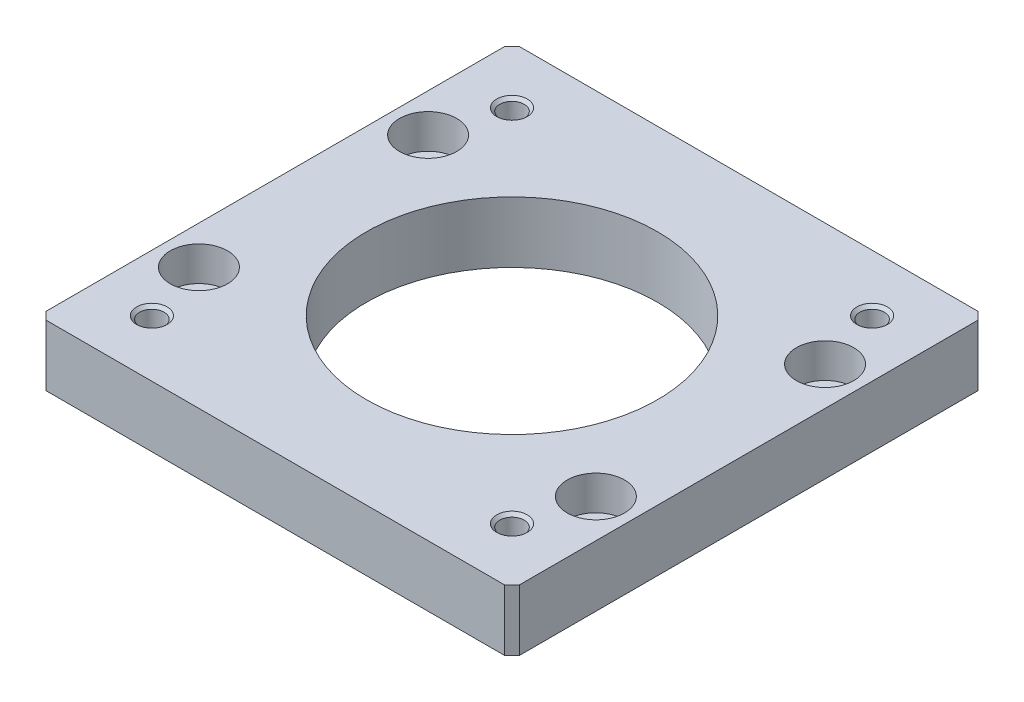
ISO-10303-21;
HEADER;
FILE_DESCRIPTION(('STEP AP214'),'2;1');
FILE_NAME('part.step','',(''),(''),'','','');
FILE_SCHEMA(('AUTOMOTIVE_DESIGN { 1 0 10303 214 1 1 1 1 }'));
ENDSEC;
DATA;
#1=APPLICATION_CONTEXT('core data for automotive mechanical design processes');
#2=APPLICATION_PROTOCOL_DEFINITION('international standard','automotive_design',2000,#1);
#3=PRODUCT_CONTEXT('',#1,'mechanical');
#4=PRODUCT('Part','Part','',(#3));
#5=PRODUCT_RELATED_PRODUCT_CATEGORY('part','',(#4));
#6=PRODUCT_DEFINITION_FORMATION('','',#4);
#7=PRODUCT_DEFINITION_CONTEXT('part definition',#1,'design');
#8=PRODUCT_DEFINITION('design','',#6,#7);
#9=PRODUCT_DEFINITION_SHAPE('','',#8);
#10=(LENGTH_UNIT() NAMED_UNIT(*) SI_UNIT(.MILLI.,.METRE.));
#11=(NAMED_UNIT(*) PLANE_ANGLE_UNIT() SI_UNIT($,.RADIAN.));
#12=(NAMED_UNIT(*) SI_UNIT($,.STERADIAN.) SOLID_ANGLE_UNIT());
#13=UNCERTAINTY_MEASURE_WITH_UNIT(LENGTH_MEASURE(1.E-05),#10,'distance_accuracy_value','');
#14=(GEOMETRIC_REPRESENTATION_CONTEXT(3) GLOBAL_UNCERTAINTY_ASSIGNED_CONTEXT((#13)) GLOBAL_UNIT_ASSIGNED_CONTEXT((#10,
#11,#12)) REPRESENTATION_CONTEXT('',''));
#15=CARTESIAN_POINT('',(0.,0.,0.));
#16=DIRECTION('',(0.,0.,1.));
#17=DIRECTION('',(1.,0.,0.));
#18=AXIS2_PLACEMENT_3D('',#15,#16,#17);
#19=CARTESIAN_POINT('',(-23.57,7.59999999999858,-23.57));
#20=DIRECTION('',(0.,1.,0.));
#21=DIRECTION('',(-1.,0.,0.));
#22=AXIS2_PLACEMENT_3D('',#19,#20,#21);
#23=CONICAL_SURFACE('',#22,1.60000000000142,0.785398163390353);
#24=CARTESIAN_POINT('',(-23.57,7.6,-23.57));
#25=DIRECTION('',(0.,1.,0.));
#26=DIRECTION('',(1.,0.,0.));
#27=AXIS2_PLACEMENT_3D('',#24,#25,#26);
#28=CIRCLE('',#27,1.6);
#29=CARTESIAN_POINT('',(-21.97,7.6,-23.57));
#30=VERTEX_POINT('',#29);
#31=EDGE_CURVE('E191',#30,#30,#28,.F.);
#32=ORIENTED_EDGE('',*,*,#31,.T.);
#33=EDGE_LOOP('',(#32));
#34=FACE_BOUND('',#33,.T.);
#35=CARTESIAN_POINT('',(-23.57,8.00000000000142,-23.57));
#36=DIRECTION('',(0.,1.,0.));
#37=DIRECTION('',(-1.,0.,0.));
#38=AXIS2_PLACEMENT_3D('',#35,#36,#37);
#39=CIRCLE('',#38,1.99999999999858);
#40=CARTESIAN_POINT('',(-25.5699999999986,8.00000000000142,-23.57));
#41=VERTEX_POINT('',#40);
#42=EDGE_CURVE('E174',#41,#41,#39,.T.);
#43=ORIENTED_EDGE('',*,*,#42,.T.);
#44=EDGE_LOOP('',(#43));
#45=FACE_BOUND('',#44,.T.);
#46=ADVANCED_FACE('F16',(#34,#45),#23,.F.);
#47=CARTESIAN_POINT('',(23.57,7.59999999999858,-23.57));
#48=DIRECTION('',(0.,1.,0.));
#49=DIRECTION('',(0.,0.,1.));
#50=AXIS2_PLACEMENT_3D('',#47,#48,#49);
#51=CONICAL_SURFACE('',#50,1.60000000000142,0.78539816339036);
#52=CARTESIAN_POINT('',(23.57,7.6,-23.57));
#53=DIRECTION('',(0.,1.,0.));
#54=DIRECTION('',(1.,0.,0.));
#55=AXIS2_PLACEMENT_3D('',#52,#53,#54);
#56=CIRCLE('',#55,1.6);
#57=CARTESIAN_POINT('',(25.17,7.6,-23.57));
#58=VERTEX_POINT('',#57);
#59=EDGE_CURVE('E195',#58,#58,#56,.F.);
#60=ORIENTED_EDGE('',*,*,#59,.T.);
#61=EDGE_LOOP('',(#60));
#62=FACE_BOUND('',#61,.T.);
#63=CARTESIAN_POINT('',(23.57,8.00000000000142,-23.57));
#64=DIRECTION('',(0.,1.,0.));
#65=DIRECTION('',(0.,0.,1.));
#66=AXIS2_PLACEMENT_3D('',#63,#64,#65);
#67=CIRCLE('',#66,1.99999999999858);
#68=CARTESIAN_POINT('',(23.57,8.00000000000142,-21.5700000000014));
#69=VERTEX_POINT('',#68);
#70=EDGE_CURVE('E171',#69,#69,#67,.T.);
#71=ORIENTED_EDGE('',*,*,#70,.T.);
#72=EDGE_LOOP('',(#71));
#73=FACE_BOUND('',#72,.T.);
#74=ADVANCED_FACE('F359',(#62,#73),#51,.F.);
#75=CARTESIAN_POINT('',(-23.57,7.59999999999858,23.57));
#76=DIRECTION('',(0.,1.,0.));
#77=DIRECTION('',(0.,0.,1.));
#78=AXIS2_PLACEMENT_3D('',#75,#76,#77);
#79=CONICAL_SURFACE('',#78,1.60000000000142,0.78539816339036);
#80=CARTESIAN_POINT('',(-23.57,7.6,23.57));
#81=DIRECTION('',(0.,1.,0.));
#82=DIRECTION('',(1.,0.,0.));
#83=AXIS2_PLACEMENT_3D('',#80,#81,#82);
#84=CIRCLE('',#83,1.6);
#85=CARTESIAN_POINT('',(-21.97,7.6,23.57));
#86=VERTEX_POINT('',#85);
#87=EDGE_CURVE('E208',#86,#86,#84,.F.);
#88=ORIENTED_EDGE('',*,*,#87,.T.);
#89=EDGE_LOOP('',(#88));
#90=FACE_BOUND('',#89,.T.);
#91=CARTESIAN_POINT('',(-23.57,8.00000000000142,23.57));
#92=DIRECTION('',(0.,1.,0.));
#93=DIRECTION('',(0.,0.,1.));
#94=AXIS2_PLACEMENT_3D('',#91,#92,#93);
#95=CIRCLE('',#94,1.99999999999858);
#96=CARTESIAN_POINT('',(-23.57,8.00000000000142,25.5699999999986));
#97=VERTEX_POINT('',#96);
#98=EDGE_CURVE('E168',#97,#97,#95,.T.);
#99=ORIENTED_EDGE('',*,*,#98,.T.);
#100=EDGE_LOOP('',(#99));
#101=FACE_BOUND('',#100,.T.);
#102=ADVANCED_FACE('F355',(#90,#101),#79,.F.);
#103=CARTESIAN_POINT('',(23.57,7.59999999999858,23.57));
#104=DIRECTION('',(0.,1.,0.));
#105=DIRECTION('',(-1.,0.,0.));
#106=AXIS2_PLACEMENT_3D('',#103,#104,#105);
#107=CONICAL_SURFACE('',#106,1.60000000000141,0.785398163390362);
#108=CARTESIAN_POINT('',(23.57,7.6,23.57));
#109=DIRECTION('',(0.,1.,0.));
#110=DIRECTION('',(1.,0.,0.));
#111=AXIS2_PLACEMENT_3D('',#108,#109,#110);
#112=CIRCLE('',#111,1.6);
#113=CARTESIAN_POINT('',(25.17,7.6,23.57));
#114=VERTEX_POINT('',#113);
#115=EDGE_CURVE('E200',#114,#114,#112,.F.);
#116=ORIENTED_EDGE('',*,*,#115,.T.);
#117=EDGE_LOOP('',(#116));
#118=FACE_BOUND('',#117,.T.);
#119=CARTESIAN_POINT('',(23.57,8.00000000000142,23.57));
#120=DIRECTION('',(0.,1.,0.));
#121=DIRECTION('',(-1.,0.,0.));
#122=AXIS2_PLACEMENT_3D('',#119,#120,#121);
#123=CIRCLE('',#122,1.99999999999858);
#124=CARTESIAN_POINT('',(21.5700000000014,8.00000000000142,23.57));
#125=VERTEX_POINT('',#124);
#126=EDGE_CURVE('E165',#125,#125,#123,.T.);
#127=ORIENTED_EDGE('',*,*,#126,.T.);
#128=EDGE_LOOP('',(#127));
#129=FACE_BOUND('',#128,.T.);
#130=ADVANCED_FACE('F352',(#118,#129),#107,.F.);
#131=CARTESIAN_POINT('',(25.98076211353,3.5,-15.));
#132=DIRECTION('',(0.,1.,0.));
#133=DIRECTION('',(0.,0.,1.));
#134=AXIS2_PLACEMENT_3D('',#131,#132,#133);
#135=CYLINDRICAL_SURFACE('',#134,3.75);
#136=CARTESIAN_POINT('',(25.98076211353,3.5,-15.));
#137=DIRECTION('',(0.,1.,0.));
#138=DIRECTION('',(0.,0.,1.));
#139=AXIS2_PLACEMENT_3D('',#136,#137,#138);
#140=CIRCLE('',#139,3.75);
#141=CARTESIAN_POINT('',(25.98076211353,3.5,-11.25));
#142=VERTEX_POINT('',#141);
#143=EDGE_CURVE('E20',#142,#142,#140,.F.);
#144=ORIENTED_EDGE('',*,*,#143,.T.);
#145=EDGE_LOOP('',(#144));
#146=FACE_BOUND('',#145,.T.);
#147=CARTESIAN_POINT('',(25.98076211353,8.,-15.));
#148=DIRECTION('',(0.,1.,0.));
#149=DIRECTION('',(0.,0.,1.));
#150=AXIS2_PLACEMENT_3D('',#147,#148,#149);
#151=CIRCLE('',#150,3.75);
#152=CARTESIAN_POINT('',(25.98076211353,8.,-11.25));
#153=VERTEX_POINT('',#152);
#154=EDGE_CURVE('E162',#153,#153,#151,.T.);
#155=ORIENTED_EDGE('',*,*,#154,.T.);
#156=EDGE_LOOP('',(#155));
#157=FACE_BOUND('',#156,.T.);
#158=ADVANCED_FACE('F348',(#146,#157),#135,.F.);
#159=CARTESIAN_POINT('',(-25.98076211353,3.5,-15.));
#160=DIRECTION('',(0.,1.,0.));
#161=DIRECTION('',(0.,0.,1.));
#162=AXIS2_PLACEMENT_3D('',#159,#160,#161);
#163=CYLINDRICAL_SURFACE('',#162,3.75);
#164=CARTESIAN_POINT('',(-25.98076211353,3.5,-15.));
#165=DIRECTION('',(0.,1.,0.));
#166=DIRECTION('',(0.,0.,1.));
#167=AXIS2_PLACEMENT_3D('',#164,#165,#166);
#168=CIRCLE('',#167,3.75);
#169=CARTESIAN_POINT('',(-25.98076211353,3.5,-11.25));
#170=VERTEX_POINT('',#169);
#171=EDGE_CURVE('E184',#170,#170,#168,.F.);
#172=ORIENTED_EDGE('',*,*,#171,.T.);
#173=EDGE_LOOP('',(#172));
#174=FACE_BOUND('',#173,.T.);
#175=CARTESIAN_POINT('',(-25.98076211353,8.,-15.));
#176=DIRECTION('',(0.,1.,0.));
#177=DIRECTION('',(0.,0.,1.));
#178=AXIS2_PLACEMENT_3D('',#175,#176,#177);
#179=CIRCLE('',#178,3.75);
#180=CARTESIAN_POINT('',(-25.98076211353,8.,-11.25));
#181=VERTEX_POINT('',#180);
#182=EDGE_CURVE('E159',#181,#181,#179,.T.);
#183=ORIENTED_EDGE('',*,*,#182,.T.);
#184=EDGE_LOOP('',(#183));
#185=FACE_BOUND('',#184,.T.);
#186=ADVANCED_FACE('F344',(#174,#185),#163,.F.);
#187=CARTESIAN_POINT('',(-25.98076211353,3.5,15.));
#188=DIRECTION('',(0.,1.,0.));
#189=DIRECTION('',(0.,0.,1.));
#190=AXIS2_PLACEMENT_3D('',#187,#188,#189);
#191=CYLINDRICAL_SURFACE('',#190,3.75);
#192=CARTESIAN_POINT('',(-25.98076211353,3.5,15.));
#193=DIRECTION('',(0.,1.,0.));
#194=DIRECTION('',(0.,0.,1.));
#195=AXIS2_PLACEMENT_3D('',#192,#193,#194);
#196=CIRCLE('',#195,3.75);
#197=CARTESIAN_POINT('',(-25.98076211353,3.5,18.75));
#198=VERTEX_POINT('',#197);
#199=EDGE_CURVE('E90',#198,#198,#196,.F.);
#200=ORIENTED_EDGE('',*,*,#199,.T.);
#201=EDGE_LOOP('',(#200));
#202=FACE_BOUND('',#201,.T.);
#203=CARTESIAN_POINT('',(-25.98076211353,8.,15.));
#204=DIRECTION('',(0.,1.,0.));
#205=DIRECTION('',(0.,0.,1.));
#206=AXIS2_PLACEMENT_3D('',#203,#204,#205);
#207=CIRCLE('',#206,3.75);
#208=CARTESIAN_POINT('',(-25.98076211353,8.,18.75));
#209=VERTEX_POINT('',#208);
#210=EDGE_CURVE('E107',#209,#209,#207,.T.);
#211=ORIENTED_EDGE('',*,*,#210,.T.);
#212=EDGE_LOOP('',(#211));
#213=FACE_BOUND('',#212,.T.);
#214=ADVANCED_FACE('F341',(#202,#213),#191,.F.);
#215=CARTESIAN_POINT('',(25.98076211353,3.5,15.));
#216=DIRECTION('',(0.,1.,0.));
#217=DIRECTION('',(0.,0.,1.));
#218=AXIS2_PLACEMENT_3D('',#215,#216,#217);
#219=CYLINDRICAL_SURFACE('',#218,3.75);
#220=CARTESIAN_POINT('',(25.98076211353,3.5,15.));
#221=DIRECTION('',(0.,1.,0.));
#222=DIRECTION('',(0.,0.,1.));
#223=AXIS2_PLACEMENT_3D('',#220,#221,#222);
#224=CIRCLE('',#223,3.75);
#225=CARTESIAN_POINT('',(25.98076211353,3.5,18.75));
#226=VERTEX_POINT('',#225);
#227=EDGE_CURVE('E186',#226,#226,#224,.F.);
#228=ORIENTED_EDGE('',*,*,#227,.T.);
#229=EDGE_LOOP('',(#228));
#230=FACE_BOUND('',#229,.T.);
#231=CARTESIAN_POINT('',(25.98076211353,8.,15.));
#232=DIRECTION('',(0.,1.,0.));
#233=DIRECTION('',(0.,0.,1.));
#234=AXIS2_PLACEMENT_3D('',#231,#232,#233);
#235=CIRCLE('',#234,3.75);
#236=CARTESIAN_POINT('',(25.98076211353,8.,18.75));
#237=VERTEX_POINT('',#236);
#238=EDGE_CURVE('E104',#237,#237,#235,.T.);
#239=ORIENTED_EDGE('',*,*,#238,.T.);
#240=EDGE_LOOP('',(#239));
#241=FACE_BOUND('',#240,.T.);
#242=ADVANCED_FACE('F338',(#230,#241),#219,.F.);
#243=CARTESIAN_POINT('',(-31.08184,8.16,-29.91816));
#244=DIRECTION('',(-0.707106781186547,0.,-0.707106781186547));
#245=DIRECTION('',(0.707106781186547,0.,-0.707106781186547));
#246=AXIS2_PLACEMENT_3D('',#243,#244,#245);
#247=PLANE('',#246);
#248=DIRECTION('',(0.707106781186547,0.,-0.707106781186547));
#249=VECTOR('',#248,1.);
#250=CARTESIAN_POINT('',(-31.08184,8.,-29.91816));
#251=LINE('',#250,#249);
#252=CARTESIAN_POINT('',(-31.,8.,-30.));
#253=VERTEX_POINT('',#252);
#254=CARTESIAN_POINT('',(-30.,8.,-31.));
#255=VERTEX_POINT('',#254);
#256=EDGE_CURVE('E177',#253,#255,#251,.T.);
#257=ORIENTED_EDGE('',*,*,#256,.T.);
#258=DIRECTION('',(0.,1.,0.));
#259=VECTOR('',#258,1.);
#260=CARTESIAN_POINT('',(-30.,4.,-31.));
#261=LINE('',#260,#259);
#262=CARTESIAN_POINT('',(-30.,0.,-31.));
#263=VERTEX_POINT('',#262);
#264=EDGE_CURVE('E100',#255,#263,#261,.F.);
#265=ORIENTED_EDGE('',*,*,#264,.T.);
#266=DIRECTION('',(-0.707106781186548,0.,0.707106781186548));
#267=VECTOR('',#266,1.);
#268=CARTESIAN_POINT('',(-30.5,0.,-30.5));
#269=LINE('',#268,#267);
#270=CARTESIAN_POINT('',(-31.,0.,-30.));
#271=VERTEX_POINT('',#270);
#272=EDGE_CURVE('E203',#271,#263,#269,.F.);
#273=ORIENTED_EDGE('',*,*,#272,.F.);
#274=DIRECTION('',(0.,-1.,0.));
#275=VECTOR('',#274,1.);
#276=CARTESIAN_POINT('',(-31.,4.,-30.));
#277=LINE('',#276,#275);
#278=EDGE_CURVE('E215',#271,#253,#277,.F.);
#279=ORIENTED_EDGE('',*,*,#278,.T.);
#280=EDGE_LOOP('',(#257,#265,#273,#279));
#281=FACE_BOUND('',#280,.T.);
#282=ADVANCED_FACE('F261',(#281),#247,.T.);
#283=CARTESIAN_POINT('',(-29.91816,8.16,31.08184));
#284=DIRECTION('',(-0.707106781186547,0.,0.707106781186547));
#285=DIRECTION('',(-0.707106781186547,0.,-0.707106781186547));
#286=AXIS2_PLACEMENT_3D('',#283,#284,#285);
#287=PLANE('',#286);
#288=DIRECTION('',(-0.707106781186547,0.,-0.707106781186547));
#289=VECTOR('',#288,1.);
#290=CARTESIAN_POINT('',(-29.91816,8.,31.08184));
#291=LINE('',#290,#289);
#292=CARTESIAN_POINT('',(-30.,8.,31.));
#293=VERTEX_POINT('',#292);
#294=CARTESIAN_POINT('',(-31.,8.,30.));
#295=VERTEX_POINT('',#294);
#296=EDGE_CURVE('E179',#293,#295,#291,.T.);
#297=ORIENTED_EDGE('',*,*,#296,.T.);
#298=DIRECTION('',(0.,1.,0.));
#299=VECTOR('',#298,1.);
#300=CARTESIAN_POINT('',(-31.,4.,30.));
#301=LINE('',#300,#299);
#302=CARTESIAN_POINT('',(-31.,0.,30.));
#303=VERTEX_POINT('',#302);
#304=EDGE_CURVE('E214',#295,#303,#301,.F.);
#305=ORIENTED_EDGE('',*,*,#304,.T.);
#306=DIRECTION('',(0.707106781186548,0.,0.707106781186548));
#307=VECTOR('',#306,1.);
#308=CARTESIAN_POINT('',(-30.5,0.,30.5));
#309=LINE('',#308,#307);
#310=CARTESIAN_POINT('',(-30.,0.,31.));
#311=VERTEX_POINT('',#310);
#312=EDGE_CURVE('E257',#311,#303,#309,.F.);
#313=ORIENTED_EDGE('',*,*,#312,.F.);
#314=DIRECTION('',(0.,-1.,0.));
#315=VECTOR('',#314,1.);
#316=CARTESIAN_POINT('',(-30.,4.,31.));
#317=LINE('',#316,#315);
#318=EDGE_CURVE('E222',#311,#293,#317,.F.);
#319=ORIENTED_EDGE('',*,*,#318,.T.);
#320=EDGE_LOOP('',(#297,#305,#313,#319));
#321=FACE_BOUND('',#320,.T.);
#322=ADVANCED_FACE('F267',(#321),#287,.T.);
#323=CARTESIAN_POINT('',(29.91816,8.16,-31.08184));
#324=DIRECTION('',(0.707106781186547,0.,-0.707106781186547));
#325=DIRECTION('',(0.707106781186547,0.,0.707106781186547));
#326=AXIS2_PLACEMENT_3D('',#323,#324,#325);
#327=PLANE('',#326);
#328=DIRECTION('',(0.707106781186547,0.,0.707106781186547));
#329=VECTOR('',#328,1.);
#330=CARTESIAN_POINT('',(29.91816,8.,-31.08184));
#331=LINE('',#330,#329);
#332=CARTESIAN_POINT('',(30.,8.,-31.));
#333=VERTEX_POINT('',#332);
#334=CARTESIAN_POINT('',(31.,8.,-30.));
#335=VERTEX_POINT('',#334);
#336=EDGE_CURVE('E80',#333,#335,#331,.T.);
#337=ORIENTED_EDGE('',*,*,#336,.T.);
#338=DIRECTION('',(0.,1.,0.));
#339=VECTOR('',#338,1.);
#340=CARTESIAN_POINT('',(31.,4.,-30.));
#341=LINE('',#340,#339);
#342=CARTESIAN_POINT('',(31.,0.,-30.));
#343=VERTEX_POINT('',#342);
#344=EDGE_CURVE('E113',#335,#343,#341,.F.);
#345=ORIENTED_EDGE('',*,*,#344,.T.);
#346=DIRECTION('',(-0.707106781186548,0.,-0.707106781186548));
#347=VECTOR('',#346,1.);
#348=CARTESIAN_POINT('',(30.5,0.,-30.5));
#349=LINE('',#348,#347);
#350=CARTESIAN_POINT('',(30.,0.,-31.));
#351=VERTEX_POINT('',#350);
#352=EDGE_CURVE('E103',#351,#343,#349,.F.);
#353=ORIENTED_EDGE('',*,*,#352,.F.);
#354=DIRECTION('',(0.,-1.,0.));
#355=VECTOR('',#354,1.);
#356=CARTESIAN_POINT('',(30.,4.,-31.));
#357=LINE('',#356,#355);
#358=EDGE_CURVE('E97',#351,#333,#357,.F.);
#359=ORIENTED_EDGE('',*,*,#358,.T.);
#360=EDGE_LOOP('',(#337,#345,#353,#359));
#361=FACE_BOUND('',#360,.T.);
#362=ADVANCED_FACE('F102',(#361),#327,.T.);
#363=CARTESIAN_POINT('',(31.08184,8.16,29.91816));
#364=DIRECTION('',(0.707106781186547,0.,0.707106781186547));
#365=DIRECTION('',(-0.707106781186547,0.,0.707106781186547));
#366=AXIS2_PLACEMENT_3D('',#363,#364,#365);
#367=PLANE('',#366);
#368=DIRECTION('',(-0.707106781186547,0.,0.707106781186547));
#369=VECTOR('',#368,1.);
#370=CARTESIAN_POINT('',(31.08184,8.,29.91816));
#371=LINE('',#370,#369);
#372=CARTESIAN_POINT('',(31.,8.,30.));
#373=VERTEX_POINT('',#372);
#374=CARTESIAN_POINT('',(30.,8.,31.));
#375=VERTEX_POINT('',#374);
#376=EDGE_CURVE('E89',#373,#375,#371,.T.);
#377=ORIENTED_EDGE('',*,*,#376,.T.);
#378=DIRECTION('',(0.,1.,0.));
#379=VECTOR('',#378,1.);
#380=CARTESIAN_POINT('',(30.,4.,31.));
#381=LINE('',#380,#379);
#382=CARTESIAN_POINT('',(30.,0.,31.));
#383=VERTEX_POINT('',#382);
#384=EDGE_CURVE('E111',#375,#383,#381,.F.);
#385=ORIENTED_EDGE('',*,*,#384,.T.);
#386=DIRECTION('',(0.707106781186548,0.,-0.707106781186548));
#387=VECTOR('',#386,1.);
#388=CARTESIAN_POINT('',(30.5,0.,30.5));
#389=LINE('',#388,#387);
#390=CARTESIAN_POINT('',(31.,0.,30.));
#391=VERTEX_POINT('',#390);
#392=EDGE_CURVE('E35',#391,#383,#389,.F.);
#393=ORIENTED_EDGE('',*,*,#392,.F.);
#394=DIRECTION('',(0.,-1.,0.));
#395=VECTOR('',#394,1.);
#396=CARTESIAN_POINT('',(31.,4.,30.));
#397=LINE('',#396,#395);
#398=EDGE_CURVE('E114',#391,#373,#397,.F.);
#399=ORIENTED_EDGE('',*,*,#398,.T.);
#400=EDGE_LOOP('',(#377,#385,#393,#399));
#401=FACE_BOUND('',#400,.T.);
#402=ADVANCED_FACE('F228',(#401),#367,.T.);
#403=CARTESIAN_POINT('',(-23.57,0.4,23.57));
#404=DIRECTION('',(0.,1.,0.));
#405=DIRECTION('',(0.,0.,1.));
#406=AXIS2_PLACEMENT_3D('',#403,#404,#405);
#407=CYLINDRICAL_SURFACE('',#406,1.6);
#408=CARTESIAN_POINT('',(-23.57,0.400000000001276,23.57));
#409=DIRECTION('',(0.,-1.,0.));
#410=DIRECTION('',(0.,0.,-1.));
#411=AXIS2_PLACEMENT_3D('',#408,#409,#410);
#412=CIRCLE('',#411,1.60000000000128);
#413=CARTESIAN_POINT('',(-23.57,0.400000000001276,21.9699999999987));
#414=VERTEX_POINT('',#413);
#415=EDGE_CURVE('E227',#414,#414,#412,.T.);
#416=ORIENTED_EDGE('',*,*,#415,.T.);
#417=EDGE_LOOP('',(#416));
#418=FACE_BOUND('',#417,.T.);
#419=ORIENTED_EDGE('',*,*,#87,.F.);
#420=EDGE_LOOP('',(#419));
#421=FACE_BOUND('',#420,.T.);
#422=ADVANCED_FACE('F333',(#418,#421),#407,.F.);
#423=CARTESIAN_POINT('',(23.57,0.4,23.57));
#424=DIRECTION('',(0.,1.,0.));
#425=DIRECTION('',(0.,0.,1.));
#426=AXIS2_PLACEMENT_3D('',#423,#424,#425);
#427=CYLINDRICAL_SURFACE('',#426,1.6);
#428=CARTESIAN_POINT('',(23.57,0.400000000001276,23.57));
#429=DIRECTION('',(0.,-1.,0.));
#430=DIRECTION('',(0.,0.,-1.));
#431=AXIS2_PLACEMENT_3D('',#428,#429,#430);
#432=CIRCLE('',#431,1.60000000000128);
#433=CARTESIAN_POINT('',(23.57,0.400000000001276,21.9699999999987));
#434=VERTEX_POINT('',#433);
#435=EDGE_CURVE('E251',#434,#434,#432,.T.);
#436=ORIENTED_EDGE('',*,*,#435,.T.);
#437=EDGE_LOOP('',(#436));
#438=FACE_BOUND('',#437,.T.);
#439=ORIENTED_EDGE('',*,*,#115,.F.);
#440=EDGE_LOOP('',(#439));
#441=FACE_BOUND('',#440,.T.);
#442=ADVANCED_FACE('F329',(#438,#441),#427,.F.);
#443=CARTESIAN_POINT('',(23.57,0.4,-23.57));
#444=DIRECTION('',(0.,1.,0.));
#445=DIRECTION('',(0.,0.,1.));
#446=AXIS2_PLACEMENT_3D('',#443,#444,#445);
#447=CYLINDRICAL_SURFACE('',#446,1.6);
#448=CARTESIAN_POINT('',(23.57,0.40000000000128,-23.57));
#449=DIRECTION('',(0.,-1.,0.));
#450=DIRECTION('',(0.,0.,-1.));
#451=AXIS2_PLACEMENT_3D('',#448,#449,#450);
#452=CIRCLE('',#451,1.60000000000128);
#453=CARTESIAN_POINT('',(23.57,0.40000000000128,-25.1700000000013));
#454=VERTEX_POINT('',#453);
#455=EDGE_CURVE('E248',#454,#454,#452,.T.);
#456=ORIENTED_EDGE('',*,*,#455,.T.);
#457=EDGE_LOOP('',(#456));
#458=FACE_BOUND('',#457,.T.);
#459=ORIENTED_EDGE('',*,*,#59,.F.);
#460=EDGE_LOOP('',(#459));
#461=FACE_BOUND('',#460,.T.);
#462=ADVANCED_FACE('F325',(#458,#461),#447,.F.);
#463=CARTESIAN_POINT('',(-23.57,0.4,-23.57));
#464=DIRECTION('',(0.,1.,0.));
#465=DIRECTION('',(0.,0.,1.));
#466=AXIS2_PLACEMENT_3D('',#463,#464,#465);
#467=CYLINDRICAL_SURFACE('',#466,1.6);
#468=CARTESIAN_POINT('',(-23.57,0.40000000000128,-23.57));
#469=DIRECTION('',(0.,-1.,0.));
#470=DIRECTION('',(0.,0.,-1.));
#471=AXIS2_PLACEMENT_3D('',#468,#469,#470);
#472=CIRCLE('',#471,1.60000000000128);
#473=CARTESIAN_POINT('',(-23.57,0.40000000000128,-25.1700000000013));
#474=VERTEX_POINT('',#473);
#475=EDGE_CURVE('E155',#474,#474,#472,.T.);
#476=ORIENTED_EDGE('',*,*,#475,.T.);
#477=EDGE_LOOP('',(#476));
#478=FACE_BOUND('',#477,.T.);
#479=ORIENTED_EDGE('',*,*,#31,.F.);
#480=EDGE_LOOP('',(#479));
#481=FACE_BOUND('',#480,.T.);
#482=ADVANCED_FACE('F321',(#478,#481),#467,.F.);
#483=CARTESIAN_POINT('',(-30.91999259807,3.5,19.50812731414));
#484=DIRECTION('',(0.,1.,0.));
#485=DIRECTION('',(1.,0.,0.));
#486=AXIS2_PLACEMENT_3D('',#483,#484,#485);
#487=PLANE('',#486);
#488=CARTESIAN_POINT('',(25.98076211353,3.5,-15.));
#489=DIRECTION('',(0.,1.,0.));
#490=DIRECTION('',(0.,0.,1.));
#491=AXIS2_PLACEMENT_3D('',#488,#489,#490);
#492=CIRCLE('',#491,2.25);
#493=CARTESIAN_POINT('',(25.98076211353,3.5,-12.75));
#494=VERTEX_POINT('',#493);
#495=EDGE_CURVE('E153',#494,#494,#492,.F.);
#496=ORIENTED_EDGE('',*,*,#495,.T.);
#497=EDGE_LOOP('',(#496));
#498=FACE_BOUND('',#497,.T.);
#499=ORIENTED_EDGE('',*,*,#143,.F.);
#500=EDGE_LOOP('',(#499));
#501=FACE_BOUND('',#500,.T.);
#502=ADVANCED_FACE('F324',(#498,#501),#487,.T.);
#503=CARTESIAN_POINT('',(-30.91999259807,3.5,19.50812731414));
#504=DIRECTION('',(0.,1.,0.));
#505=DIRECTION('',(1.,0.,0.));
#506=AXIS2_PLACEMENT_3D('',#503,#504,#505);
#507=PLANE('',#506);
#508=CARTESIAN_POINT('',(25.98076211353,3.5,15.));
#509=DIRECTION('',(0.,1.,0.));
#510=DIRECTION('',(0.,0.,1.));
#511=AXIS2_PLACEMENT_3D('',#508,#509,#510);
#512=CIRCLE('',#511,2.25);
#513=CARTESIAN_POINT('',(25.98076211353,3.5,17.25));
#514=VERTEX_POINT('',#513);
#515=EDGE_CURVE('E150',#514,#514,#512,.F.);
#516=ORIENTED_EDGE('',*,*,#515,.T.);
#517=EDGE_LOOP('',(#516));
#518=FACE_BOUND('',#517,.T.);
#519=ORIENTED_EDGE('',*,*,#227,.F.);
#520=EDGE_LOOP('',(#519));
#521=FACE_BOUND('',#520,.T.);
#522=ADVANCED_FACE('F376',(#518,#521),#507,.T.);
#523=CARTESIAN_POINT('',(-30.91999259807,3.5,19.50812731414));
#524=DIRECTION('',(0.,1.,0.));
#525=DIRECTION('',(1.,0.,0.));
#526=AXIS2_PLACEMENT_3D('',#523,#524,#525);
#527=PLANE('',#526);
#528=CARTESIAN_POINT('',(-25.98076211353,3.5,-15.));
#529=DIRECTION('',(0.,1.,0.));
#530=DIRECTION('',(0.,0.,1.));
#531=AXIS2_PLACEMENT_3D('',#528,#529,#530);
#532=CIRCLE('',#531,2.25);
#533=CARTESIAN_POINT('',(-25.98076211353,3.5,-12.75));
#534=VERTEX_POINT('',#533);
#535=EDGE_CURVE('E147',#534,#534,#532,.F.);
#536=ORIENTED_EDGE('',*,*,#535,.T.);
#537=EDGE_LOOP('',(#536));
#538=FACE_BOUND('',#537,.T.);
#539=ORIENTED_EDGE('',*,*,#171,.F.);
#540=EDGE_LOOP('',(#539));
#541=FACE_BOUND('',#540,.T.);
#542=ADVANCED_FACE('F380',(#538,#541),#527,.T.);
#543=CARTESIAN_POINT('',(-30.91999259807,3.5,19.50812731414));
#544=DIRECTION('',(0.,1.,0.));
#545=DIRECTION('',(1.,0.,0.));
#546=AXIS2_PLACEMENT_3D('',#543,#544,#545);
#547=PLANE('',#546);
#548=CARTESIAN_POINT('',(-25.98076211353,3.5,15.));
#549=DIRECTION('',(0.,1.,0.));
#550=DIRECTION('',(0.,0.,1.));
#551=AXIS2_PLACEMENT_3D('',#548,#549,#550);
#552=CIRCLE('',#551,2.25);
#553=CARTESIAN_POINT('',(-25.98076211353,3.5,17.25));
#554=VERTEX_POINT('',#553);
#555=EDGE_CURVE('E144',#554,#554,#552,.F.);
#556=ORIENTED_EDGE('',*,*,#555,.T.);
#557=EDGE_LOOP('',(#556));
#558=FACE_BOUND('',#557,.T.);
#559=ORIENTED_EDGE('',*,*,#199,.F.);
#560=EDGE_LOOP('',(#559));
#561=FACE_BOUND('',#560,.T.);
#562=ADVANCED_FACE('F384',(#558,#561),#547,.T.);
#563=CARTESIAN_POINT('',(-32.24,8.,32.24));
#564=DIRECTION('',(0.,1.,0.));
#565=DIRECTION('',(1.,0.,0.));
#566=AXIS2_PLACEMENT_3D('',#563,#564,#565);
#567=PLANE('',#566);
#568=CARTESIAN_POINT('',(0.,8.,0.));
#569=DIRECTION('',(0.,1.,0.));
#570=DIRECTION('',(0.,0.,1.));
#571=AXIS2_PLACEMENT_3D('',#568,#569,#570);
#572=CIRCLE('',#571,19.05);
#573=CARTESIAN_POINT('',(0.,8.,19.05));
#574=VERTEX_POINT('',#573);
#575=EDGE_CURVE('E140',#574,#574,#572,.F.);
#576=ORIENTED_EDGE('',*,*,#575,.T.);
#577=EDGE_LOOP('',(#576));
#578=FACE_BOUND('',#577,.T.);
#579=ORIENTED_EDGE('',*,*,#238,.F.);
#580=EDGE_LOOP('',(#579));
#581=FACE_BOUND('',#580,.T.);
#582=ORIENTED_EDGE('',*,*,#210,.F.);
#583=EDGE_LOOP('',(#582));
#584=FACE_BOUND('',#583,.T.);
#585=ORIENTED_EDGE('',*,*,#182,.F.);
#586=EDGE_LOOP('',(#585));
#587=FACE_BOUND('',#586,.T.);
#588=ORIENTED_EDGE('',*,*,#154,.F.);
#589=EDGE_LOOP('',(#588));
#590=FACE_BOUND('',#589,.T.);
#591=ORIENTED_EDGE('',*,*,#126,.F.);
#592=EDGE_LOOP('',(#591));
#593=FACE_BOUND('',#592,.T.);
#594=ORIENTED_EDGE('',*,*,#98,.F.);
#595=EDGE_LOOP('',(#594));
#596=FACE_BOUND('',#595,.T.);
#597=ORIENTED_EDGE('',*,*,#70,.F.);
#598=EDGE_LOOP('',(#597));
#599=FACE_BOUND('',#598,.T.);
#600=ORIENTED_EDGE('',*,*,#42,.F.);
#601=EDGE_LOOP('',(#600));
#602=FACE_BOUND('',#601,.T.);
#603=ORIENTED_EDGE('',*,*,#256,.F.);
#604=DIRECTION('',(0.,0.,-1.));
#605=VECTOR('',#604,1.);
#606=CARTESIAN_POINT('',(-31.,8.,0.));
#607=LINE('',#606,#605);
#608=EDGE_CURVE('E211',#253,#295,#607,.F.);
#609=ORIENTED_EDGE('',*,*,#608,.T.);
#610=ORIENTED_EDGE('',*,*,#296,.F.);
#611=DIRECTION('',(-1.,0.,0.));
#612=VECTOR('',#611,1.);
#613=CARTESIAN_POINT('',(0.,8.,31.));
#614=LINE('',#613,#612);
#615=EDGE_CURVE('E219',#293,#375,#614,.F.);
#616=ORIENTED_EDGE('',*,*,#615,.T.);
#617=ORIENTED_EDGE('',*,*,#376,.F.);
#618=DIRECTION('',(0.,0.,1.));
#619=VECTOR('',#618,1.);
#620=CARTESIAN_POINT('',(31.,8.,0.));
#621=LINE('',#620,#619);
#622=EDGE_CURVE('E85',#373,#335,#621,.F.);
#623=ORIENTED_EDGE('',*,*,#622,.T.);
#624=ORIENTED_EDGE('',*,*,#336,.F.);
#625=DIRECTION('',(1.,0.,0.));
#626=VECTOR('',#625,1.);
#627=CARTESIAN_POINT('',(0.,8.,-31.));
#628=LINE('',#627,#626);
#629=EDGE_CURVE('E83',#333,#255,#628,.F.);
#630=ORIENTED_EDGE('',*,*,#629,.T.);
#631=EDGE_LOOP('',(#603,#609,#610,#616,#617,#623,#624,#630));
#632=FACE_BOUND('',#631,.T.);
#633=ADVANCED_FACE('F82',(#578,#581,#584,#587,#590,#593,#596,#599,#602,#632),#567,.T.);
#634=CARTESIAN_POINT('',(31.2,-0.16,-31.));
#635=DIRECTION('',(0.,0.,-1.));
#636=DIRECTION('',(-1.,0.,0.));
#637=AXIS2_PLACEMENT_3D('',#634,#635,#636);
#638=PLANE('',#637);
#639=ORIENTED_EDGE('',*,*,#264,.F.);
#640=ORIENTED_EDGE('',*,*,#629,.F.);
#641=ORIENTED_EDGE('',*,*,#358,.F.);
#642=DIRECTION('',(-1.,0.,0.));
#643=VECTOR('',#642,1.);
#644=CARTESIAN_POINT('',(0.,0.,-31.));
#645=LINE('',#644,#643);
#646=EDGE_CURVE('E143',#351,#263,#645,.T.);
#647=ORIENTED_EDGE('',*,*,#646,.T.);
#648=EDGE_LOOP('',(#639,#640,#641,#647));
#649=FACE_BOUND('',#648,.T.);
#650=ADVANCED_FACE('F95',(#649),#638,.T.);
#651=CARTESIAN_POINT('',(-31.,-0.16,-31.2));
#652=DIRECTION('',(-1.,0.,0.));
#653=DIRECTION('',(0.,0.,1.));
#654=AXIS2_PLACEMENT_3D('',#651,#652,#653);
#655=PLANE('',#654);
#656=ORIENTED_EDGE('',*,*,#304,.F.);
#657=ORIENTED_EDGE('',*,*,#608,.F.);
#658=ORIENTED_EDGE('',*,*,#278,.F.);
#659=DIRECTION('',(0.,0.,1.));
#660=VECTOR('',#659,1.);
#661=CARTESIAN_POINT('',(-31.,0.,0.));
#662=LINE('',#661,#660);
#663=EDGE_CURVE('E240',#271,#303,#662,.T.);
#664=ORIENTED_EDGE('',*,*,#663,.T.);
#665=EDGE_LOOP('',(#656,#657,#658,#664));
#666=FACE_BOUND('',#665,.T.);
#667=ADVANCED_FACE('F265',(#666),#655,.T.);
#668=CARTESIAN_POINT('',(-31.2,-0.16,31.));
#669=DIRECTION('',(0.,0.,1.));
#670=DIRECTION('',(1.,0.,0.));
#671=AXIS2_PLACEMENT_3D('',#668,#669,#670);
#672=PLANE('',#671);
#673=ORIENTED_EDGE('',*,*,#384,.F.);
#674=ORIENTED_EDGE('',*,*,#615,.F.);
#675=ORIENTED_EDGE('',*,*,#318,.F.);
#676=DIRECTION('',(1.,0.,0.));
#677=VECTOR('',#676,1.);
#678=CARTESIAN_POINT('',(0.,0.,31.));
#679=LINE('',#678,#677);
#680=EDGE_CURVE('E237',#311,#383,#679,.T.);
#681=ORIENTED_EDGE('',*,*,#680,.T.);
#682=EDGE_LOOP('',(#673,#674,#675,#681));
#683=FACE_BOUND('',#682,.T.);
#684=ADVANCED_FACE('F271',(#683),#672,.T.);
#685=CARTESIAN_POINT('',(31.,-0.16,31.2));
#686=DIRECTION('',(1.,0.,0.));
#687=DIRECTION('',(0.,0.,-1.));
#688=AXIS2_PLACEMENT_3D('',#685,#686,#687);
#689=PLANE('',#688);
#690=ORIENTED_EDGE('',*,*,#398,.F.);
#691=DIRECTION('',(0.,0.,-1.));
#692=VECTOR('',#691,1.);
#693=CARTESIAN_POINT('',(31.,0.,0.));
#694=LINE('',#693,#692);
#695=EDGE_CURVE('E139',#391,#343,#694,.T.);
#696=ORIENTED_EDGE('',*,*,#695,.T.);
#697=ORIENTED_EDGE('',*,*,#344,.F.);
#698=ORIENTED_EDGE('',*,*,#622,.F.);
#699=EDGE_LOOP('',(#690,#696,#697,#698));
#700=FACE_BOUND('',#699,.T.);
#701=ADVANCED_FACE('F233',(#700),#689,.T.);
#702=CARTESIAN_POINT('',(-23.57,0.40000000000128,23.57));
#703=DIRECTION('',(0.,-1.,0.));
#704=DIRECTION('',(0.,0.,-1.));
#705=AXIS2_PLACEMENT_3D('',#702,#703,#704);
#706=CONICAL_SURFACE('',#705,1.60000000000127,0.785398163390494);
#707=ORIENTED_EDGE('',*,*,#415,.F.);
#708=EDGE_LOOP('',(#707));
#709=FACE_BOUND('',#708,.T.);
#710=CARTESIAN_POINT('',(-23.57,-1.50530629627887E-12,23.57));
#711=DIRECTION('',(0.,-1.,0.));
#712=DIRECTION('',(0.,0.,-1.));
#713=AXIS2_PLACEMENT_3D('',#710,#711,#712);
#714=CIRCLE('',#713,1.9999999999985);
#715=CARTESIAN_POINT('',(-23.57,-1.50530629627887E-12,21.5700000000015));
#716=VERTEX_POINT('',#715);
#717=EDGE_CURVE('E136',#716,#716,#714,.T.);
#718=ORIENTED_EDGE('',*,*,#717,.T.);
#719=EDGE_LOOP('',(#718));
#720=FACE_BOUND('',#719,.T.);
#721=ADVANCED_FACE('F279',(#709,#720),#706,.F.);
#722=CARTESIAN_POINT('',(23.57,0.400000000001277,23.57));
#723=DIRECTION('',(0.,-1.,0.));
#724=DIRECTION('',(0.,0.,-1.));
#725=AXIS2_PLACEMENT_3D('',#722,#723,#724);
#726=CONICAL_SURFACE('',#725,1.60000000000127,0.785398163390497);
#727=ORIENTED_EDGE('',*,*,#435,.F.);
#728=EDGE_LOOP('',(#727));
#729=FACE_BOUND('',#728,.T.);
#730=CARTESIAN_POINT('',(23.57,-1.5031378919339E-12,23.57));
#731=DIRECTION('',(0.,-1.,0.));
#732=DIRECTION('',(0.,0.,-1.));
#733=AXIS2_PLACEMENT_3D('',#730,#731,#732);
#734=CIRCLE('',#733,1.99999999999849);
#735=CARTESIAN_POINT('',(23.57,-1.5031378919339E-12,21.5700000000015));
#736=VERTEX_POINT('',#735);
#737=EDGE_CURVE('E133',#736,#736,#734,.T.);
#738=ORIENTED_EDGE('',*,*,#737,.T.);
#739=EDGE_LOOP('',(#738));
#740=FACE_BOUND('',#739,.T.);
#741=ADVANCED_FACE('F309',(#729,#740),#726,.F.);
#742=CARTESIAN_POINT('',(23.57,0.400000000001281,-23.57));
#743=DIRECTION('',(0.,-1.,0.));
#744=DIRECTION('',(0.,0.,-1.));
#745=AXIS2_PLACEMENT_3D('',#742,#743,#744);
#746=CONICAL_SURFACE('',#745,1.60000000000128,0.785398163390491);
#747=ORIENTED_EDGE('',*,*,#455,.F.);
#748=EDGE_LOOP('',(#747));
#749=FACE_BOUND('',#748,.T.);
#750=CARTESIAN_POINT('',(23.57,-1.50270421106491E-12,-23.57));
#751=DIRECTION('',(0.,-1.,0.));
#752=DIRECTION('',(0.,0.,-1.));
#753=AXIS2_PLACEMENT_3D('',#750,#751,#752);
#754=CIRCLE('',#753,1.9999999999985);
#755=CARTESIAN_POINT('',(23.57,-1.50270421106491E-12,-25.5699999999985));
#756=VERTEX_POINT('',#755);
#757=EDGE_CURVE('E130',#756,#756,#754,.T.);
#758=ORIENTED_EDGE('',*,*,#757,.T.);
#759=EDGE_LOOP('',(#758));
#760=FACE_BOUND('',#759,.T.);
#761=ADVANCED_FACE('F315',(#749,#760),#746,.F.);
#762=CARTESIAN_POINT('',(-23.57,0.400000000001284,-23.57));
#763=DIRECTION('',(0.,-1.,0.));
#764=DIRECTION('',(0.,0.,-1.));
#765=AXIS2_PLACEMENT_3D('',#762,#763,#764);
#766=CONICAL_SURFACE('',#765,1.60000000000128,0.785398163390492);
#767=ORIENTED_EDGE('',*,*,#475,.F.);
#768=EDGE_LOOP('',(#767));
#769=FACE_BOUND('',#768,.T.);
#770=CARTESIAN_POINT('',(-23.57,-1.50140316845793E-12,-23.57));
#771=DIRECTION('',(0.,-1.,0.));
#772=DIRECTION('',(0.,0.,-1.));
#773=AXIS2_PLACEMENT_3D('',#770,#771,#772);
#774=CIRCLE('',#773,1.9999999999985);
#775=CARTESIAN_POINT('',(-23.57,-1.50140316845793E-12,-25.5699999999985));
#776=VERTEX_POINT('',#775);
#777=EDGE_CURVE('E127',#776,#776,#774,.T.);
#778=ORIENTED_EDGE('',*,*,#777,.T.);
#779=EDGE_LOOP('',(#778));
#780=FACE_BOUND('',#779,.T.);
#781=ADVANCED_FACE('F435',(#769,#780),#766,.F.);
#782=CARTESIAN_POINT('',(25.98076211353,0.,-15.));
#783=DIRECTION('',(0.,1.,0.));
#784=DIRECTION('',(0.,0.,1.));
#785=AXIS2_PLACEMENT_3D('',#782,#783,#784);
#786=CYLINDRICAL_SURFACE('',#785,2.25);
#787=CARTESIAN_POINT('',(25.98076211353,0.,-15.));
#788=DIRECTION('',(0.,1.,0.));
#789=DIRECTION('',(0.,0.,1.));
#790=AXIS2_PLACEMENT_3D('',#787,#788,#789);
#791=CIRCLE('',#790,2.25);
#792=CARTESIAN_POINT('',(25.98076211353,0.,-12.75));
#793=VERTEX_POINT('',#792);
#794=EDGE_CURVE('E124',#793,#793,#791,.F.);
#795=ORIENTED_EDGE('',*,*,#794,.T.);
#796=EDGE_LOOP('',(#795));
#797=FACE_BOUND('',#796,.T.);
#798=ORIENTED_EDGE('',*,*,#495,.F.);
#799=EDGE_LOOP('',(#798));
#800=FACE_BOUND('',#799,.T.);
#801=ADVANCED_FACE('F444',(#797,#800),#786,.F.);
#802=CARTESIAN_POINT('',(25.98076211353,0.,15.));
#803=DIRECTION('',(0.,1.,0.));
#804=DIRECTION('',(0.,0.,1.));
#805=AXIS2_PLACEMENT_3D('',#802,#803,#804);
#806=CYLINDRICAL_SURFACE('',#805,2.25);
#807=CARTESIAN_POINT('',(25.98076211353,0.,15.));
#808=DIRECTION('',(0.,1.,0.));
#809=DIRECTION('',(0.,0.,1.));
#810=AXIS2_PLACEMENT_3D('',#807,#808,#809);
#811=CIRCLE('',#810,2.25);
#812=CARTESIAN_POINT('',(25.98076211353,0.,17.25));
#813=VERTEX_POINT('',#812);
#814=EDGE_CURVE('E121',#813,#813,#811,.F.);
#815=ORIENTED_EDGE('',*,*,#814,.T.);
#816=EDGE_LOOP('',(#815));
#817=FACE_BOUND('',#816,.T.);
#818=ORIENTED_EDGE('',*,*,#515,.F.);
#819=EDGE_LOOP('',(#818));
#820=FACE_BOUND('',#819,.T.);
#821=ADVANCED_FACE('F454',(#817,#820),#806,.F.);
#822=CARTESIAN_POINT('',(-25.98076211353,0.,-15.));
#823=DIRECTION('',(0.,1.,0.));
#824=DIRECTION('',(0.,0.,1.));
#825=AXIS2_PLACEMENT_3D('',#822,#823,#824);
#826=CYLINDRICAL_SURFACE('',#825,2.25);
#827=CARTESIAN_POINT('',(-25.98076211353,0.,-15.));
#828=DIRECTION('',(0.,1.,0.));
#829=DIRECTION('',(0.,0.,1.));
#830=AXIS2_PLACEMENT_3D('',#827,#828,#829);
#831=CIRCLE('',#830,2.25);
#832=CARTESIAN_POINT('',(-25.98076211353,0.,-12.75));
#833=VERTEX_POINT('',#832);
#834=EDGE_CURVE('E118',#833,#833,#831,.F.);
#835=ORIENTED_EDGE('',*,*,#834,.T.);
#836=EDGE_LOOP('',(#835));
#837=FACE_BOUND('',#836,.T.);
#838=ORIENTED_EDGE('',*,*,#535,.F.);
#839=EDGE_LOOP('',(#838));
#840=FACE_BOUND('',#839,.T.);
#841=ADVANCED_FACE('F464',(#837,#840),#826,.F.);
#842=CARTESIAN_POINT('',(-25.98076211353,0.,15.));
#843=DIRECTION('',(0.,1.,0.));
#844=DIRECTION('',(0.,0.,1.));
#845=AXIS2_PLACEMENT_3D('',#842,#843,#844);
#846=CYLINDRICAL_SURFACE('',#845,2.25);
#847=CARTESIAN_POINT('',(-25.98076211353,0.,15.));
#848=DIRECTION('',(0.,1.,0.));
#849=DIRECTION('',(0.,0.,1.));
#850=AXIS2_PLACEMENT_3D('',#847,#848,#849);
#851=CIRCLE('',#850,2.25);
#852=CARTESIAN_POINT('',(-25.98076211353,0.,17.25));
#853=VERTEX_POINT('',#852);
#854=EDGE_CURVE('E26',#853,#853,#851,.F.);
#855=ORIENTED_EDGE('',*,*,#854,.T.);
#856=EDGE_LOOP('',(#855));
#857=FACE_BOUND('',#856,.T.);
#858=ORIENTED_EDGE('',*,*,#555,.F.);
#859=EDGE_LOOP('',(#858));
#860=FACE_BOUND('',#859,.T.);
#861=ADVANCED_FACE('F287',(#857,#860),#846,.F.);
#862=CARTESIAN_POINT('',(0.,0.,0.));
#863=DIRECTION('',(0.,1.,0.));
#864=DIRECTION('',(0.,0.,1.));
#865=AXIS2_PLACEMENT_3D('',#862,#863,#864);
#866=CYLINDRICAL_SURFACE('',#865,19.05);
#867=ORIENTED_EDGE('',*,*,#575,.F.);
#868=EDGE_LOOP('',(#867));
#869=FACE_BOUND('',#868,.T.);
#870=CARTESIAN_POINT('',(0.,0.,0.));
#871=DIRECTION('',(0.,1.,0.));
#872=DIRECTION('',(0.,0.,1.));
#873=AXIS2_PLACEMENT_3D('',#870,#871,#872);
#874=CIRCLE('',#873,19.05);
#875=CARTESIAN_POINT('',(0.,0.,19.05));
#876=VERTEX_POINT('',#875);
#877=EDGE_CURVE('E10',#876,#876,#874,.F.);
#878=ORIENTED_EDGE('',*,*,#877,.T.);
#879=EDGE_LOOP('',(#878));
#880=FACE_BOUND('',#879,.T.);
#881=ADVANCED_FACE('F282',(#869,#880),#866,.F.);
#882=CARTESIAN_POINT('',(-32.24,0.,32.24));
#883=DIRECTION('',(0.,1.,0.));
#884=DIRECTION('',(1.,0.,0.));
#885=AXIS2_PLACEMENT_3D('',#882,#883,#884);
#886=PLANE('',#885);
#887=ORIENTED_EDGE('',*,*,#877,.F.);
#888=EDGE_LOOP('',(#887));
#889=FACE_BOUND('',#888,.T.);
#890=ORIENTED_EDGE('',*,*,#854,.F.);
#891=EDGE_LOOP('',(#890));
#892=FACE_BOUND('',#891,.T.);
#893=ORIENTED_EDGE('',*,*,#834,.F.);
#894=EDGE_LOOP('',(#893));
#895=FACE_BOUND('',#894,.T.);
#896=ORIENTED_EDGE('',*,*,#814,.F.);
#897=EDGE_LOOP('',(#896));
#898=FACE_BOUND('',#897,.T.);
#899=ORIENTED_EDGE('',*,*,#794,.F.);
#900=EDGE_LOOP('',(#899));
#901=FACE_BOUND('',#900,.T.);
#902=ORIENTED_EDGE('',*,*,#777,.F.);
#903=EDGE_LOOP('',(#902));
#904=FACE_BOUND('',#903,.T.);
#905=ORIENTED_EDGE('',*,*,#757,.F.);
#906=EDGE_LOOP('',(#905));
#907=FACE_BOUND('',#906,.T.);
#908=ORIENTED_EDGE('',*,*,#737,.F.);
#909=EDGE_LOOP('',(#908));
#910=FACE_BOUND('',#909,.T.);
#911=ORIENTED_EDGE('',*,*,#717,.F.);
#912=EDGE_LOOP('',(#911));
#913=FACE_BOUND('',#912,.T.);
#914=ORIENTED_EDGE('',*,*,#392,.T.);
#915=ORIENTED_EDGE('',*,*,#680,.F.);
#916=ORIENTED_EDGE('',*,*,#312,.T.);
#917=ORIENTED_EDGE('',*,*,#663,.F.);
#918=ORIENTED_EDGE('',*,*,#272,.T.);
#919=ORIENTED_EDGE('',*,*,#646,.F.);
#920=ORIENTED_EDGE('',*,*,#352,.T.);
#921=ORIENTED_EDGE('',*,*,#695,.F.);
#922=EDGE_LOOP('',(#914,#915,#916,#917,#918,#919,#920,#921));
#923=FACE_BOUND('',#922,.T.);
#924=ADVANCED_FACE('F18',(#889,#892,#895,#898,#901,#904,#907,#910,#913,#923),#886,.F.);
#925=CLOSED_SHELL('',(#46,#74,#102,#130,#158,#186,#214,#242,#282,#322,#362,#402,#422,#442,#462,
#482,#502,#522,#542,#562,#633,#650,#667,#684,#701,#721,#741,#761,#781,#801,#821,#841,#861,#881,#924));
#926=MANIFOLD_SOLID_BREP('B1',#925);
#927=ADVANCED_BREP_SHAPE_REPRESENTATION('',(#18,#926),#14);
#928=SHAPE_DEFINITION_REPRESENTATION(#9,#927);
ENDSEC;
END-ISO-10303-21;
